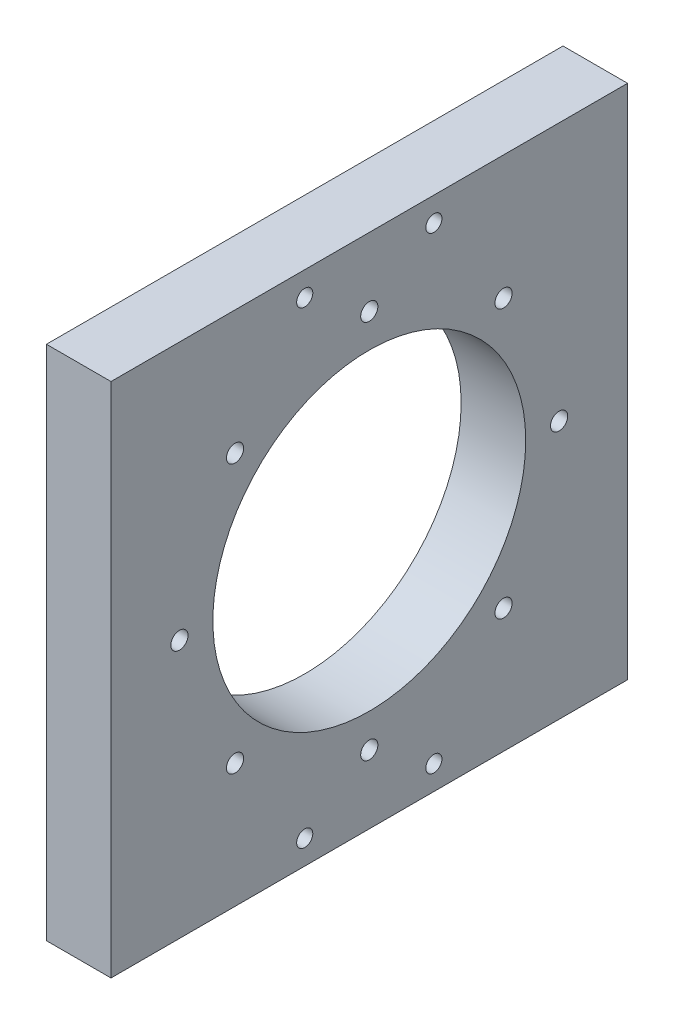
ISO-10303-21;
HEADER;
FILE_DESCRIPTION(('STEP AP214'),'2;1');
FILE_NAME('part.step','',(''),(''),'','','');
FILE_SCHEMA(('AUTOMOTIVE_DESIGN { 1 0 10303 214 1 1 1 1 }'));
ENDSEC;
DATA;
#1=APPLICATION_CONTEXT('core data for automotive mechanical design processes');
#2=APPLICATION_PROTOCOL_DEFINITION('international standard','automotive_design',2000,#1);
#3=PRODUCT_CONTEXT('',#1,'mechanical');
#4=PRODUCT('Part','Part','',(#3));
#5=PRODUCT_RELATED_PRODUCT_CATEGORY('part','',(#4));
#6=PRODUCT_DEFINITION_FORMATION('','',#4);
#7=PRODUCT_DEFINITION_CONTEXT('part definition',#1,'design');
#8=PRODUCT_DEFINITION('design','',#6,#7);
#9=PRODUCT_DEFINITION_SHAPE('','',#8);
#10=(LENGTH_UNIT() NAMED_UNIT(*) SI_UNIT(.MILLI.,.METRE.));
#11=(NAMED_UNIT(*) PLANE_ANGLE_UNIT() SI_UNIT($,.RADIAN.));
#12=(NAMED_UNIT(*) SI_UNIT($,.STERADIAN.) SOLID_ANGLE_UNIT());
#13=UNCERTAINTY_MEASURE_WITH_UNIT(LENGTH_MEASURE(1.E-05),#10,'distance_accuracy_value','');
#14=(GEOMETRIC_REPRESENTATION_CONTEXT(3) GLOBAL_UNCERTAINTY_ASSIGNED_CONTEXT((#13)) GLOBAL_UNIT_ASSIGNED_CONTEXT((#10,
#11,#12)) REPRESENTATION_CONTEXT('',''));
#15=CARTESIAN_POINT('',(0.,0.,0.));
#16=DIRECTION('',(0.,0.,1.));
#17=DIRECTION('',(1.,0.,0.));
#18=AXIS2_PLACEMENT_3D('',#15,#16,#17);
#19=CARTESIAN_POINT('',(25.4,0.,0.));
#20=DIRECTION('',(-1.,0.,0.));
#21=DIRECTION('',(0.,0.,1.));
#22=AXIS2_PLACEMENT_3D('',#19,#20,#21);
#23=PLANE('',#22);
#24=CARTESIAN_POINT('',(25.4,92.075,-25.4));
#25=DIRECTION('',(-1.,0.,0.));
#26=DIRECTION('',(0.,0.,1.));
#27=AXIS2_PLACEMENT_3D('',#24,#25,#26);
#28=CIRCLE('',#27,3.175);
#29=CARTESIAN_POINT('',(25.4,92.075,-22.225));
#30=VERTEX_POINT('',#29);
#31=EDGE_CURVE('E182',#30,#30,#28,.T.);
#32=ORIENTED_EDGE('',*,*,#31,.T.);
#33=EDGE_LOOP('',(#32));
#34=FACE_BOUND('',#33,.T.);
#35=CARTESIAN_POINT('',(25.4,92.075,25.4));
#36=DIRECTION('',(-1.,0.,0.));
#37=DIRECTION('',(0.,0.,1.));
#38=AXIS2_PLACEMENT_3D('',#35,#36,#37);
#39=CIRCLE('',#38,3.175);
#40=CARTESIAN_POINT('',(25.4,92.075,28.575));
#41=VERTEX_POINT('',#40);
#42=EDGE_CURVE('E176',#41,#41,#39,.T.);
#43=ORIENTED_EDGE('',*,*,#42,.T.);
#44=EDGE_LOOP('',(#43));
#45=FACE_BOUND('',#44,.T.);
#46=CARTESIAN_POINT('',(25.4,52.8039059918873,-52.803905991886));
#47=DIRECTION('',(-1.,0.,0.));
#48=DIRECTION('',(0.,0.,1.));
#49=AXIS2_PLACEMENT_3D('',#46,#47,#48);
#50=CIRCLE('',#49,3.3782);
#51=CARTESIAN_POINT('',(25.4,52.8039059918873,-49.425705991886));
#52=VERTEX_POINT('',#51);
#53=EDGE_CURVE('E170',#52,#52,#50,.T.);
#54=ORIENTED_EDGE('',*,*,#53,.T.);
#55=EDGE_LOOP('',(#54));
#56=FACE_BOUND('',#55,.T.);
#57=CARTESIAN_POINT('',(25.4,7.82189581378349E-13,-74.676));
#58=DIRECTION('',(-1.,0.,0.));
#59=DIRECTION('',(0.,0.,1.));
#60=AXIS2_PLACEMENT_3D('',#57,#58,#59);
#61=CIRCLE('',#60,3.37819999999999);
#62=CARTESIAN_POINT('',(25.4,7.82189581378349E-13,-71.2978));
#63=VERTEX_POINT('',#62);
#64=EDGE_CURVE('E164',#63,#63,#61,.T.);
#65=ORIENTED_EDGE('',*,*,#64,.T.);
#66=EDGE_LOOP('',(#65));
#67=FACE_BOUND('',#66,.T.);
#68=CARTESIAN_POINT('',(25.4,-52.8039059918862,-52.8039059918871));
#69=DIRECTION('',(-1.,0.,0.));
#70=DIRECTION('',(0.,0.,1.));
#71=AXIS2_PLACEMENT_3D('',#68,#69,#70);
#72=CIRCLE('',#71,3.3782);
#73=CARTESIAN_POINT('',(25.4,-52.8039059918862,-49.4257059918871));
#74=VERTEX_POINT('',#73);
#75=EDGE_CURVE('E158',#74,#74,#72,.T.);
#76=ORIENTED_EDGE('',*,*,#75,.T.);
#77=EDGE_LOOP('',(#76));
#78=FACE_BOUND('',#77,.T.);
#79=CARTESIAN_POINT('',(25.4,-74.676,0.));
#80=DIRECTION('',(-1.,0.,0.));
#81=DIRECTION('',(0.,0.,1.));
#82=AXIS2_PLACEMENT_3D('',#79,#80,#81);
#83=CIRCLE('',#82,3.3782);
#84=CARTESIAN_POINT('',(25.4,-74.676,3.3782));
#85=VERTEX_POINT('',#84);
#86=EDGE_CURVE('E152',#85,#85,#83,.T.);
#87=ORIENTED_EDGE('',*,*,#86,.T.);
#88=EDGE_LOOP('',(#87));
#89=FACE_BOUND('',#88,.T.);
#90=CARTESIAN_POINT('',(25.4,-52.8039059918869,52.8039059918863));
#91=DIRECTION('',(-1.,0.,0.));
#92=DIRECTION('',(0.,0.,1.));
#93=AXIS2_PLACEMENT_3D('',#90,#91,#92);
#94=CIRCLE('',#93,3.3782);
#95=CARTESIAN_POINT('',(25.4,-52.8039059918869,56.1821059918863));
#96=VERTEX_POINT('',#95);
#97=EDGE_CURVE('E146',#96,#96,#94,.T.);
#98=ORIENTED_EDGE('',*,*,#97,.T.);
#99=EDGE_LOOP('',(#98));
#100=FACE_BOUND('',#99,.T.);
#101=CARTESIAN_POINT('',(25.4,-2.6072986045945E-13,74.676));
#102=DIRECTION('',(-1.,0.,0.));
#103=DIRECTION('',(0.,0.,1.));
#104=AXIS2_PLACEMENT_3D('',#101,#102,#103);
#105=CIRCLE('',#104,3.37819999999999);
#106=CARTESIAN_POINT('',(25.4,-2.6072986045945E-13,78.0542));
#107=VERTEX_POINT('',#106);
#108=EDGE_CURVE('E140',#107,#107,#105,.T.);
#109=ORIENTED_EDGE('',*,*,#108,.T.);
#110=EDGE_LOOP('',(#109));
#111=FACE_BOUND('',#110,.T.);
#112=CARTESIAN_POINT('',(25.4,52.8039059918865,52.8039059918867));
#113=DIRECTION('',(-1.,0.,0.));
#114=DIRECTION('',(0.,0.,1.));
#115=AXIS2_PLACEMENT_3D('',#112,#113,#114);
#116=CIRCLE('',#115,3.3782);
#117=CARTESIAN_POINT('',(25.4,52.8039059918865,56.1821059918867));
#118=VERTEX_POINT('',#117);
#119=EDGE_CURVE('E134',#118,#118,#116,.T.);
#120=ORIENTED_EDGE('',*,*,#119,.T.);
#121=EDGE_LOOP('',(#120));
#122=FACE_BOUND('',#121,.T.);
#123=CARTESIAN_POINT('',(25.4,74.676,0.));
#124=DIRECTION('',(-1.,0.,0.));
#125=DIRECTION('',(0.,0.,1.));
#126=AXIS2_PLACEMENT_3D('',#123,#124,#125);
#127=CIRCLE('',#126,3.3782);
#128=CARTESIAN_POINT('',(25.4,74.676,3.3782));
#129=VERTEX_POINT('',#128);
#130=EDGE_CURVE('E128',#129,#129,#127,.T.);
#131=ORIENTED_EDGE('',*,*,#130,.T.);
#132=EDGE_LOOP('',(#131));
#133=FACE_BOUND('',#132,.T.);
#134=CARTESIAN_POINT('',(25.4,-92.075,-25.4));
#135=DIRECTION('',(-1.,0.,0.));
#136=DIRECTION('',(0.,0.,1.));
#137=AXIS2_PLACEMENT_3D('',#134,#135,#136);
#138=CIRCLE('',#137,3.175);
#139=CARTESIAN_POINT('',(25.4,-92.075,-22.225));
#140=VERTEX_POINT('',#139);
#141=EDGE_CURVE('E122',#140,#140,#138,.T.);
#142=ORIENTED_EDGE('',*,*,#141,.T.);
#143=EDGE_LOOP('',(#142));
#144=FACE_BOUND('',#143,.T.);
#145=CARTESIAN_POINT('',(25.4,-92.075,25.4));
#146=DIRECTION('',(-1.,0.,0.));
#147=DIRECTION('',(0.,0.,1.));
#148=AXIS2_PLACEMENT_3D('',#145,#146,#147);
#149=CIRCLE('',#148,3.175);
#150=CARTESIAN_POINT('',(25.4,-92.075,28.575));
#151=VERTEX_POINT('',#150);
#152=EDGE_CURVE('E114',#151,#151,#149,.T.);
#153=ORIENTED_EDGE('',*,*,#152,.T.);
#154=EDGE_LOOP('',(#153));
#155=FACE_BOUND('',#154,.T.);
#156=DIRECTION('',(0.,1.,0.));
#157=VECTOR('',#156,1.);
#158=CARTESIAN_POINT('',(25.4,-101.6,-101.6));
#159=LINE('',#158,#157);
#160=CARTESIAN_POINT('',(25.4,-101.6,-101.6));
#161=VERTEX_POINT('',#160);
#162=CARTESIAN_POINT('',(25.4,101.6,-101.6));
#163=VERTEX_POINT('',#162);
#164=EDGE_CURVE('E84',#161,#163,#159,.T.);
#165=ORIENTED_EDGE('',*,*,#164,.T.);
#166=DIRECTION('',(0.,0.,1.));
#167=VECTOR('',#166,1.);
#168=CARTESIAN_POINT('',(25.4,101.6,101.6));
#169=LINE('',#168,#167);
#170=CARTESIAN_POINT('',(25.4,101.6,101.6));
#171=VERTEX_POINT('',#170);
#172=EDGE_CURVE('E79',#163,#171,#169,.T.);
#173=ORIENTED_EDGE('',*,*,#172,.T.);
#174=DIRECTION('',(0.,-1.,0.));
#175=VECTOR('',#174,1.);
#176=CARTESIAN_POINT('',(25.4,-101.6,101.6));
#177=LINE('',#176,#175);
#178=CARTESIAN_POINT('',(25.4,-101.6,101.6));
#179=VERTEX_POINT('',#178);
#180=EDGE_CURVE('E82',#171,#179,#177,.T.);
#181=ORIENTED_EDGE('',*,*,#180,.T.);
#182=DIRECTION('',(0.,0.,-1.));
#183=VECTOR('',#182,1.);
#184=CARTESIAN_POINT('',(25.4,-101.6,101.6));
#185=LINE('',#184,#183);
#186=EDGE_CURVE('E49',#179,#161,#185,.T.);
#187=ORIENTED_EDGE('',*,*,#186,.T.);
#188=EDGE_LOOP('',(#165,#173,#181,#187));
#189=FACE_BOUND('',#188,.T.);
#190=CARTESIAN_POINT('',(25.4,0.,0.));
#191=DIRECTION('',(1.,0.,0.));
#192=DIRECTION('',(0.,0.,-1.));
#193=AXIS2_PLACEMENT_3D('',#190,#191,#192);
#194=CIRCLE('',#193,61.5315);
#195=CARTESIAN_POINT('',(25.4,0.,-61.5315));
#196=VERTEX_POINT('',#195);
#197=EDGE_CURVE('E99',#196,#196,#194,.T.);
#198=ORIENTED_EDGE('',*,*,#197,.F.);
#199=EDGE_LOOP('',(#198));
#200=FACE_BOUND('',#199,.T.);
#201=ADVANCED_FACE('F32',(#34,#45,#56,#67,#78,#89,#100,#111,#122,#133,#144,#155,#189,#200),#23,.F.);
#202=CARTESIAN_POINT('',(0.,0.,0.));
#203=DIRECTION('',(-1.,0.,0.));
#204=DIRECTION('',(0.,0.,1.));
#205=AXIS2_PLACEMENT_3D('',#202,#203,#204);
#206=PLANE('',#205);
#207=CARTESIAN_POINT('',(0.,92.075,-25.4));
#208=DIRECTION('',(-1.,0.,0.));
#209=DIRECTION('',(0.,0.,1.));
#210=AXIS2_PLACEMENT_3D('',#207,#208,#209);
#211=CIRCLE('',#210,3.17499999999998);
#212=CARTESIAN_POINT('',(0.,92.075,-22.225));
#213=VERTEX_POINT('',#212);
#214=EDGE_CURVE('E185',#213,#213,#211,.T.);
#215=ORIENTED_EDGE('',*,*,#214,.F.);
#216=EDGE_LOOP('',(#215));
#217=FACE_BOUND('',#216,.T.);
#218=CARTESIAN_POINT('',(0.,92.075,25.4));
#219=DIRECTION('',(-1.,0.,0.));
#220=DIRECTION('',(0.,0.,1.));
#221=AXIS2_PLACEMENT_3D('',#218,#219,#220);
#222=CIRCLE('',#221,3.17499999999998);
#223=CARTESIAN_POINT('',(0.,92.075,28.575));
#224=VERTEX_POINT('',#223);
#225=EDGE_CURVE('E179',#224,#224,#222,.T.);
#226=ORIENTED_EDGE('',*,*,#225,.F.);
#227=EDGE_LOOP('',(#226));
#228=FACE_BOUND('',#227,.T.);
#229=CARTESIAN_POINT('',(0.,52.8039059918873,-52.803905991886));
#230=DIRECTION('',(-1.,0.,0.));
#231=DIRECTION('',(0.,0.,1.));
#232=AXIS2_PLACEMENT_3D('',#229,#230,#231);
#233=CIRCLE('',#232,3.37819999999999);
#234=CARTESIAN_POINT('',(0.,52.8039059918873,-49.425705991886));
#235=VERTEX_POINT('',#234);
#236=EDGE_CURVE('E173',#235,#235,#233,.T.);
#237=ORIENTED_EDGE('',*,*,#236,.F.);
#238=EDGE_LOOP('',(#237));
#239=FACE_BOUND('',#238,.T.);
#240=CARTESIAN_POINT('',(0.,7.82189581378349E-13,-74.676));
#241=DIRECTION('',(-1.,0.,0.));
#242=DIRECTION('',(0.,0.,1.));
#243=AXIS2_PLACEMENT_3D('',#240,#241,#242);
#244=CIRCLE('',#243,3.37819999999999);
#245=CARTESIAN_POINT('',(0.,7.82189581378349E-13,-71.2978));
#246=VERTEX_POINT('',#245);
#247=EDGE_CURVE('E167',#246,#246,#244,.T.);
#248=ORIENTED_EDGE('',*,*,#247,.F.);
#249=EDGE_LOOP('',(#248));
#250=FACE_BOUND('',#249,.T.);
#251=CARTESIAN_POINT('',(0.,-52.8039059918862,-52.8039059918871));
#252=DIRECTION('',(-1.,0.,0.));
#253=DIRECTION('',(0.,0.,1.));
#254=AXIS2_PLACEMENT_3D('',#251,#252,#253);
#255=CIRCLE('',#254,3.37819999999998);
#256=CARTESIAN_POINT('',(0.,-52.8039059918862,-49.4257059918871));
#257=VERTEX_POINT('',#256);
#258=EDGE_CURVE('E161',#257,#257,#255,.T.);
#259=ORIENTED_EDGE('',*,*,#258,.F.);
#260=EDGE_LOOP('',(#259));
#261=FACE_BOUND('',#260,.T.);
#262=CARTESIAN_POINT('',(0.,-74.676,0.));
#263=DIRECTION('',(-1.,0.,0.));
#264=DIRECTION('',(0.,0.,1.));
#265=AXIS2_PLACEMENT_3D('',#262,#263,#264);
#266=CIRCLE('',#265,3.37819999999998);
#267=CARTESIAN_POINT('',(0.,-74.676,3.37819999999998));
#268=VERTEX_POINT('',#267);
#269=EDGE_CURVE('E155',#268,#268,#266,.T.);
#270=ORIENTED_EDGE('',*,*,#269,.F.);
#271=EDGE_LOOP('',(#270));
#272=FACE_BOUND('',#271,.T.);
#273=CARTESIAN_POINT('',(0.,-52.8039059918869,52.8039059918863));
#274=DIRECTION('',(-1.,0.,0.));
#275=DIRECTION('',(0.,0.,1.));
#276=AXIS2_PLACEMENT_3D('',#273,#274,#275);
#277=CIRCLE('',#276,3.37819999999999);
#278=CARTESIAN_POINT('',(0.,-52.8039059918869,56.1821059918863));
#279=VERTEX_POINT('',#278);
#280=EDGE_CURVE('E149',#279,#279,#277,.T.);
#281=ORIENTED_EDGE('',*,*,#280,.F.);
#282=EDGE_LOOP('',(#281));
#283=FACE_BOUND('',#282,.T.);
#284=CARTESIAN_POINT('',(0.,-2.6072986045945E-13,74.676));
#285=DIRECTION('',(-1.,0.,0.));
#286=DIRECTION('',(0.,0.,1.));
#287=AXIS2_PLACEMENT_3D('',#284,#285,#286);
#288=CIRCLE('',#287,3.37819999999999);
#289=CARTESIAN_POINT('',(0.,-2.6072986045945E-13,78.0542));
#290=VERTEX_POINT('',#289);
#291=EDGE_CURVE('E143',#290,#290,#288,.T.);
#292=ORIENTED_EDGE('',*,*,#291,.F.);
#293=EDGE_LOOP('',(#292));
#294=FACE_BOUND('',#293,.T.);
#295=CARTESIAN_POINT('',(0.,52.8039059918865,52.8039059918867));
#296=DIRECTION('',(-1.,0.,0.));
#297=DIRECTION('',(0.,0.,1.));
#298=AXIS2_PLACEMENT_3D('',#295,#296,#297);
#299=CIRCLE('',#298,3.37819999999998);
#300=CARTESIAN_POINT('',(0.,52.8039059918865,56.1821059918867));
#301=VERTEX_POINT('',#300);
#302=EDGE_CURVE('E137',#301,#301,#299,.T.);
#303=ORIENTED_EDGE('',*,*,#302,.F.);
#304=EDGE_LOOP('',(#303));
#305=FACE_BOUND('',#304,.T.);
#306=CARTESIAN_POINT('',(0.,74.676,0.));
#307=DIRECTION('',(-1.,0.,0.));
#308=DIRECTION('',(0.,0.,1.));
#309=AXIS2_PLACEMENT_3D('',#306,#307,#308);
#310=CIRCLE('',#309,3.37819999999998);
#311=CARTESIAN_POINT('',(0.,74.676,3.37819999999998));
#312=VERTEX_POINT('',#311);
#313=EDGE_CURVE('E131',#312,#312,#310,.T.);
#314=ORIENTED_EDGE('',*,*,#313,.F.);
#315=EDGE_LOOP('',(#314));
#316=FACE_BOUND('',#315,.T.);
#317=CARTESIAN_POINT('',(0.,-92.075,-25.4));
#318=DIRECTION('',(-1.,0.,0.));
#319=DIRECTION('',(0.,0.,1.));
#320=AXIS2_PLACEMENT_3D('',#317,#318,#319);
#321=CIRCLE('',#320,3.17499999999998);
#322=CARTESIAN_POINT('',(0.,-92.075,-22.225));
#323=VERTEX_POINT('',#322);
#324=EDGE_CURVE('E125',#323,#323,#321,.T.);
#325=ORIENTED_EDGE('',*,*,#324,.F.);
#326=EDGE_LOOP('',(#325));
#327=FACE_BOUND('',#326,.T.);
#328=CARTESIAN_POINT('',(0.,-92.075,25.4));
#329=DIRECTION('',(-1.,0.,0.));
#330=DIRECTION('',(0.,0.,1.));
#331=AXIS2_PLACEMENT_3D('',#328,#329,#330);
#332=CIRCLE('',#331,3.17499999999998);
#333=CARTESIAN_POINT('',(0.,-92.075,28.575));
#334=VERTEX_POINT('',#333);
#335=EDGE_CURVE('E119',#334,#334,#332,.T.);
#336=ORIENTED_EDGE('',*,*,#335,.F.);
#337=EDGE_LOOP('',(#336));
#338=FACE_BOUND('',#337,.T.);
#339=DIRECTION('',(0.,1.,0.));
#340=VECTOR('',#339,1.);
#341=CARTESIAN_POINT('',(0.,-101.6,-101.6));
#342=LINE('',#341,#340);
#343=CARTESIAN_POINT('',(0.,-101.6,-101.6));
#344=VERTEX_POINT('',#343);
#345=CARTESIAN_POINT('',(0.,101.6,-101.6));
#346=VERTEX_POINT('',#345);
#347=EDGE_CURVE('E96',#344,#346,#342,.T.);
#348=ORIENTED_EDGE('',*,*,#347,.F.);
#349=DIRECTION('',(0.,0.,-1.));
#350=VECTOR('',#349,1.);
#351=CARTESIAN_POINT('',(0.,-101.6,101.6));
#352=LINE('',#351,#350);
#353=CARTESIAN_POINT('',(0.,-101.6,101.6));
#354=VERTEX_POINT('',#353);
#355=EDGE_CURVE('E72',#354,#344,#352,.T.);
#356=ORIENTED_EDGE('',*,*,#355,.F.);
#357=DIRECTION('',(0.,-1.,0.));
#358=VECTOR('',#357,1.);
#359=CARTESIAN_POINT('',(0.,-101.6,101.6));
#360=LINE('',#359,#358);
#361=CARTESIAN_POINT('',(0.,101.6,101.6));
#362=VERTEX_POINT('',#361);
#363=EDGE_CURVE('E66',#362,#354,#360,.T.);
#364=ORIENTED_EDGE('',*,*,#363,.F.);
#365=DIRECTION('',(0.,0.,1.));
#366=VECTOR('',#365,1.);
#367=CARTESIAN_POINT('',(0.,101.6,101.6));
#368=LINE('',#367,#366);
#369=EDGE_CURVE('E88',#346,#362,#368,.T.);
#370=ORIENTED_EDGE('',*,*,#369,.F.);
#371=EDGE_LOOP('',(#348,#356,#364,#370));
#372=FACE_BOUND('',#371,.T.);
#373=CARTESIAN_POINT('',(0.,0.,0.));
#374=DIRECTION('',(1.,0.,0.));
#375=DIRECTION('',(0.,0.,-1.));
#376=AXIS2_PLACEMENT_3D('',#373,#374,#375);
#377=CIRCLE('',#376,61.5315);
#378=CARTESIAN_POINT('',(0.,0.,-61.5315));
#379=VERTEX_POINT('',#378);
#380=EDGE_CURVE('E111',#379,#379,#377,.T.);
#381=ORIENTED_EDGE('',*,*,#380,.T.);
#382=EDGE_LOOP('',(#381));
#383=FACE_BOUND('',#382,.T.);
#384=ADVANCED_FACE('F107',(#217,#228,#239,#250,#261,#272,#283,#294,#305,#316,#327,#338,#372,
#383),#206,.T.);
#385=CARTESIAN_POINT('',(25.4,-101.6,-101.6));
#386=DIRECTION('',(0.,0.,1.));
#387=DIRECTION('',(1.,0.,0.));
#388=AXIS2_PLACEMENT_3D('',#385,#386,#387);
#389=PLANE('',#388);
#390=ORIENTED_EDGE('',*,*,#347,.T.);
#391=DIRECTION('',(-1.,0.,0.));
#392=VECTOR('',#391,1.);
#393=CARTESIAN_POINT('',(25.4,101.6,-101.6));
#394=LINE('',#393,#392);
#395=EDGE_CURVE('E11',#163,#346,#394,.T.);
#396=ORIENTED_EDGE('',*,*,#395,.F.);
#397=ORIENTED_EDGE('',*,*,#164,.F.);
#398=DIRECTION('',(-1.,0.,0.));
#399=VECTOR('',#398,1.);
#400=CARTESIAN_POINT('',(25.4,-101.6,-101.6));
#401=LINE('',#400,#399);
#402=EDGE_CURVE('E92',#161,#344,#401,.T.);
#403=ORIENTED_EDGE('',*,*,#402,.T.);
#404=EDGE_LOOP('',(#390,#396,#397,#403));
#405=FACE_BOUND('',#404,.T.);
#406=ADVANCED_FACE('F34',(#405),#389,.F.);
#407=CARTESIAN_POINT('',(25.4,101.6,101.6));
#408=DIRECTION('',(0.,-1.,0.));
#409=DIRECTION('',(0.,0.,-1.));
#410=AXIS2_PLACEMENT_3D('',#407,#408,#409);
#411=PLANE('',#410);
#412=ORIENTED_EDGE('',*,*,#369,.T.);
#413=DIRECTION('',(-1.,0.,0.));
#414=VECTOR('',#413,1.);
#415=CARTESIAN_POINT('',(25.4,101.6,101.6));
#416=LINE('',#415,#414);
#417=EDGE_CURVE('E41',#171,#362,#416,.T.);
#418=ORIENTED_EDGE('',*,*,#417,.F.);
#419=ORIENTED_EDGE('',*,*,#172,.F.);
#420=ORIENTED_EDGE('',*,*,#395,.T.);
#421=EDGE_LOOP('',(#412,#418,#419,#420));
#422=FACE_BOUND('',#421,.T.);
#423=ADVANCED_FACE('F87',(#422),#411,.F.);
#424=CARTESIAN_POINT('',(25.4,-101.6,101.6));
#425=DIRECTION('',(0.,0.,-1.));
#426=DIRECTION('',(-1.,0.,0.));
#427=AXIS2_PLACEMENT_3D('',#424,#425,#426);
#428=PLANE('',#427);
#429=ORIENTED_EDGE('',*,*,#363,.T.);
#430=DIRECTION('',(-1.,0.,0.));
#431=VECTOR('',#430,1.);
#432=CARTESIAN_POINT('',(25.4,-101.6,101.6));
#433=LINE('',#432,#431);
#434=EDGE_CURVE('E89',#179,#354,#433,.T.);
#435=ORIENTED_EDGE('',*,*,#434,.F.);
#436=ORIENTED_EDGE('',*,*,#180,.F.);
#437=ORIENTED_EDGE('',*,*,#417,.T.);
#438=EDGE_LOOP('',(#429,#435,#436,#437));
#439=FACE_BOUND('',#438,.T.);
#440=ADVANCED_FACE('F90',(#439),#428,.F.);
#441=CARTESIAN_POINT('',(25.4,-101.6,101.6));
#442=DIRECTION('',(0.,1.,0.));
#443=DIRECTION('',(0.,0.,1.));
#444=AXIS2_PLACEMENT_3D('',#441,#442,#443);
#445=PLANE('',#444);
#446=ORIENTED_EDGE('',*,*,#355,.T.);
#447=ORIENTED_EDGE('',*,*,#402,.F.);
#448=ORIENTED_EDGE('',*,*,#186,.F.);
#449=ORIENTED_EDGE('',*,*,#434,.T.);
#450=EDGE_LOOP('',(#446,#447,#448,#449));
#451=FACE_BOUND('',#450,.T.);
#452=ADVANCED_FACE('F104',(#451),#445,.F.);
#453=CARTESIAN_POINT('',(25.4,0.,0.));
#454=DIRECTION('',(-1.,0.,0.));
#455=DIRECTION('',(0.,0.,1.));
#456=AXIS2_PLACEMENT_3D('',#453,#454,#455);
#457=CYLINDRICAL_SURFACE('',#456,61.5315);
#458=ORIENTED_EDGE('',*,*,#197,.T.);
#459=EDGE_LOOP('',(#458));
#460=FACE_BOUND('',#459,.T.);
#461=ORIENTED_EDGE('',*,*,#380,.F.);
#462=EDGE_LOOP('',(#461));
#463=FACE_BOUND('',#462,.T.);
#464=ADVANCED_FACE('F219',(#460,#463),#457,.F.);
#465=CARTESIAN_POINT('',(0.,-92.075,25.4));
#466=DIRECTION('',(-1.,0.,0.));
#467=DIRECTION('',(0.,0.,1.));
#468=AXIS2_PLACEMENT_3D('',#465,#466,#467);
#469=CYLINDRICAL_SURFACE('',#468,3.17499999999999);
#470=ORIENTED_EDGE('',*,*,#152,.F.);
#471=EDGE_LOOP('',(#470));
#472=FACE_BOUND('',#471,.T.);
#473=ORIENTED_EDGE('',*,*,#335,.T.);
#474=EDGE_LOOP('',(#473));
#475=FACE_BOUND('',#474,.T.);
#476=ADVANCED_FACE('F216',(#472,#475),#469,.F.);
#477=CARTESIAN_POINT('',(0.,-92.075,-25.4));
#478=DIRECTION('',(-1.,0.,0.));
#479=DIRECTION('',(0.,0.,1.));
#480=AXIS2_PLACEMENT_3D('',#477,#478,#479);
#481=CYLINDRICAL_SURFACE('',#480,3.17499999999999);
#482=ORIENTED_EDGE('',*,*,#141,.F.);
#483=EDGE_LOOP('',(#482));
#484=FACE_BOUND('',#483,.T.);
#485=ORIENTED_EDGE('',*,*,#324,.T.);
#486=EDGE_LOOP('',(#485));
#487=FACE_BOUND('',#486,.T.);
#488=ADVANCED_FACE('F218',(#484,#487),#481,.F.);
#489=CARTESIAN_POINT('',(0.,74.676,0.));
#490=DIRECTION('',(-1.,0.,0.));
#491=DIRECTION('',(0.,0.,1.));
#492=AXIS2_PLACEMENT_3D('',#489,#490,#491);
#493=CYLINDRICAL_SURFACE('',#492,3.37819999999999);
#494=ORIENTED_EDGE('',*,*,#130,.F.);
#495=EDGE_LOOP('',(#494));
#496=FACE_BOUND('',#495,.T.);
#497=ORIENTED_EDGE('',*,*,#313,.T.);
#498=EDGE_LOOP('',(#497));
#499=FACE_BOUND('',#498,.T.);
#500=ADVANCED_FACE('F226',(#496,#499),#493,.F.);
#501=CARTESIAN_POINT('',(0.,52.8039059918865,52.8039059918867));
#502=DIRECTION('',(-1.,0.,0.));
#503=DIRECTION('',(0.,0.,1.));
#504=AXIS2_PLACEMENT_3D('',#501,#502,#503);
#505=CYLINDRICAL_SURFACE('',#504,3.37819999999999);
#506=ORIENTED_EDGE('',*,*,#119,.F.);
#507=EDGE_LOOP('',(#506));
#508=FACE_BOUND('',#507,.T.);
#509=ORIENTED_EDGE('',*,*,#302,.T.);
#510=EDGE_LOOP('',(#509));
#511=FACE_BOUND('',#510,.T.);
#512=ADVANCED_FACE('F304',(#508,#511),#505,.F.);
#513=CARTESIAN_POINT('',(0.,-2.6072986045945E-13,74.676));
#514=DIRECTION('',(-1.,0.,0.));
#515=DIRECTION('',(0.,0.,1.));
#516=AXIS2_PLACEMENT_3D('',#513,#514,#515);
#517=CYLINDRICAL_SURFACE('',#516,3.37819999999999);
#518=ORIENTED_EDGE('',*,*,#108,.F.);
#519=EDGE_LOOP('',(#518));
#520=FACE_BOUND('',#519,.T.);
#521=ORIENTED_EDGE('',*,*,#291,.T.);
#522=EDGE_LOOP('',(#521));
#523=FACE_BOUND('',#522,.T.);
#524=ADVANCED_FACE('F300',(#520,#523),#517,.F.);
#525=CARTESIAN_POINT('',(0.,-52.8039059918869,52.8039059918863));
#526=DIRECTION('',(-1.,0.,0.));
#527=DIRECTION('',(0.,0.,1.));
#528=AXIS2_PLACEMENT_3D('',#525,#526,#527);
#529=CYLINDRICAL_SURFACE('',#528,3.37819999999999);
#530=ORIENTED_EDGE('',*,*,#97,.F.);
#531=EDGE_LOOP('',(#530));
#532=FACE_BOUND('',#531,.T.);
#533=ORIENTED_EDGE('',*,*,#280,.T.);
#534=EDGE_LOOP('',(#533));
#535=FACE_BOUND('',#534,.T.);
#536=ADVANCED_FACE('F296',(#532,#535),#529,.F.);
#537=CARTESIAN_POINT('',(0.,-74.676,0.));
#538=DIRECTION('',(-1.,0.,0.));
#539=DIRECTION('',(0.,0.,1.));
#540=AXIS2_PLACEMENT_3D('',#537,#538,#539);
#541=CYLINDRICAL_SURFACE('',#540,3.37819999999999);
#542=ORIENTED_EDGE('',*,*,#86,.F.);
#543=EDGE_LOOP('',(#542));
#544=FACE_BOUND('',#543,.T.);
#545=ORIENTED_EDGE('',*,*,#269,.T.);
#546=EDGE_LOOP('',(#545));
#547=FACE_BOUND('',#546,.T.);
#548=ADVANCED_FACE('F292',(#544,#547),#541,.F.);
#549=CARTESIAN_POINT('',(0.,-52.8039059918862,-52.8039059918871));
#550=DIRECTION('',(-1.,0.,0.));
#551=DIRECTION('',(0.,0.,1.));
#552=AXIS2_PLACEMENT_3D('',#549,#550,#551);
#553=CYLINDRICAL_SURFACE('',#552,3.37819999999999);
#554=ORIENTED_EDGE('',*,*,#75,.F.);
#555=EDGE_LOOP('',(#554));
#556=FACE_BOUND('',#555,.T.);
#557=ORIENTED_EDGE('',*,*,#258,.T.);
#558=EDGE_LOOP('',(#557));
#559=FACE_BOUND('',#558,.T.);
#560=ADVANCED_FACE('F288',(#556,#559),#553,.F.);
#561=CARTESIAN_POINT('',(0.,7.82189581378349E-13,-74.676));
#562=DIRECTION('',(-1.,0.,0.));
#563=DIRECTION('',(0.,0.,1.));
#564=AXIS2_PLACEMENT_3D('',#561,#562,#563);
#565=CYLINDRICAL_SURFACE('',#564,3.37819999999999);
#566=ORIENTED_EDGE('',*,*,#64,.F.);
#567=EDGE_LOOP('',(#566));
#568=FACE_BOUND('',#567,.T.);
#569=ORIENTED_EDGE('',*,*,#247,.T.);
#570=EDGE_LOOP('',(#569));
#571=FACE_BOUND('',#570,.T.);
#572=ADVANCED_FACE('F284',(#568,#571),#565,.F.);
#573=CARTESIAN_POINT('',(0.,52.8039059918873,-52.803905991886));
#574=DIRECTION('',(-1.,0.,0.));
#575=DIRECTION('',(0.,0.,1.));
#576=AXIS2_PLACEMENT_3D('',#573,#574,#575);
#577=CYLINDRICAL_SURFACE('',#576,3.37819999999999);
#578=ORIENTED_EDGE('',*,*,#53,.F.);
#579=EDGE_LOOP('',(#578));
#580=FACE_BOUND('',#579,.T.);
#581=ORIENTED_EDGE('',*,*,#236,.T.);
#582=EDGE_LOOP('',(#581));
#583=FACE_BOUND('',#582,.T.);
#584=ADVANCED_FACE('F265',(#580,#583),#577,.F.);
#585=CARTESIAN_POINT('',(0.,92.075,25.4));
#586=DIRECTION('',(-1.,0.,0.));
#587=DIRECTION('',(0.,0.,1.));
#588=AXIS2_PLACEMENT_3D('',#585,#586,#587);
#589=CYLINDRICAL_SURFACE('',#588,3.17499999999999);
#590=ORIENTED_EDGE('',*,*,#42,.F.);
#591=EDGE_LOOP('',(#590));
#592=FACE_BOUND('',#591,.T.);
#593=ORIENTED_EDGE('',*,*,#225,.T.);
#594=EDGE_LOOP('',(#593));
#595=FACE_BOUND('',#594,.T.);
#596=ADVANCED_FACE('F260',(#592,#595),#589,.F.);
#597=CARTESIAN_POINT('',(0.,92.075,-25.4));
#598=DIRECTION('',(-1.,0.,0.));
#599=DIRECTION('',(0.,0.,1.));
#600=AXIS2_PLACEMENT_3D('',#597,#598,#599);
#601=CYLINDRICAL_SURFACE('',#600,3.17499999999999);
#602=ORIENTED_EDGE('',*,*,#31,.F.);
#603=EDGE_LOOP('',(#602));
#604=FACE_BOUND('',#603,.T.);
#605=ORIENTED_EDGE('',*,*,#214,.T.);
#606=EDGE_LOOP('',(#605));
#607=FACE_BOUND('',#606,.T.);
#608=ADVANCED_FACE('F189',(#604,#607),#601,.F.);
#609=CLOSED_SHELL('',(#201,#384,#406,#423,#440,#452,#464,#476,#488,#500,#512,#524,#536,#548,
#560,#572,#584,#596,#608));
#610=MANIFOLD_SOLID_BREP('B2',#609);
#611=ADVANCED_BREP_SHAPE_REPRESENTATION('',(#18,#610),#14);
#612=SHAPE_DEFINITION_REPRESENTATION(#9,#611);
ENDSEC;
END-ISO-10303-21;
